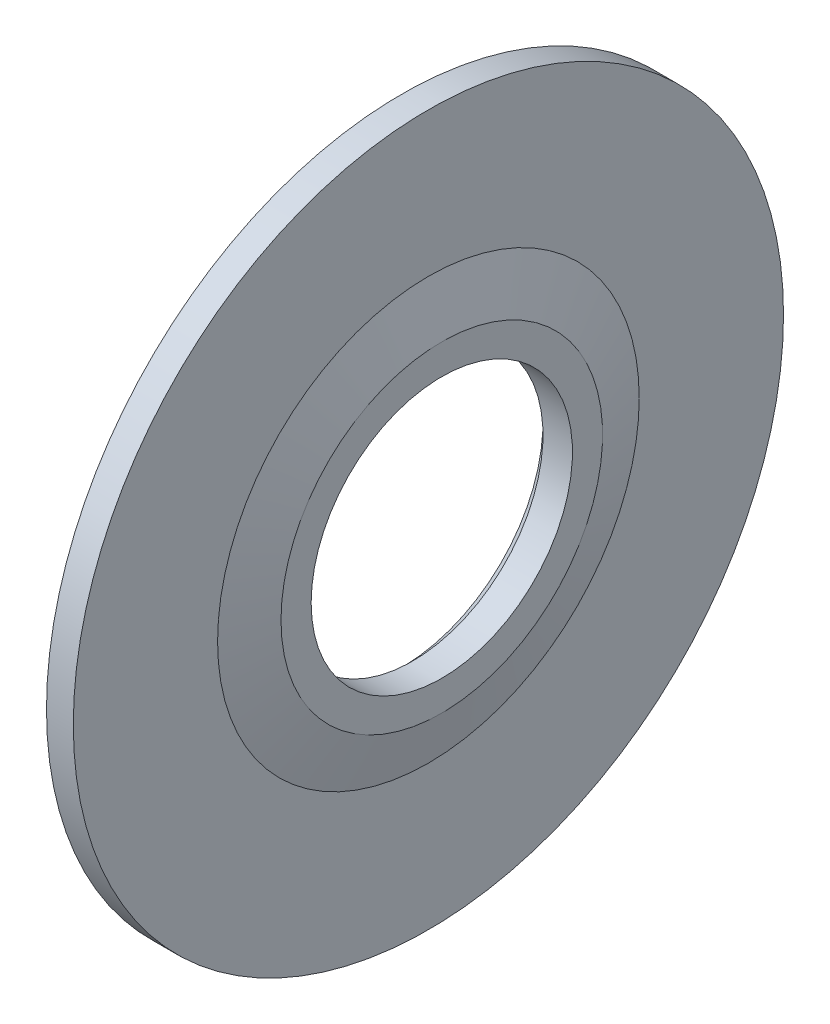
ISO-10303-21;
HEADER;
FILE_DESCRIPTION(('STEP AP214'),'2;1');
FILE_NAME('part.step','',(''),(''),'','','');
FILE_SCHEMA(('AUTOMOTIVE_DESIGN { 1 0 10303 214 1 1 1 1 }'));
ENDSEC;
DATA;
#1=APPLICATION_CONTEXT('core data for automotive mechanical design processes');
#2=APPLICATION_PROTOCOL_DEFINITION('international standard','automotive_design',2000,#1);
#3=PRODUCT_CONTEXT('',#1,'mechanical');
#4=PRODUCT('Part','Part','',(#3));
#5=PRODUCT_RELATED_PRODUCT_CATEGORY('part','',(#4));
#6=PRODUCT_DEFINITION_FORMATION('','',#4);
#7=PRODUCT_DEFINITION_CONTEXT('part definition',#1,'design');
#8=PRODUCT_DEFINITION('design','',#6,#7);
#9=PRODUCT_DEFINITION_SHAPE('','',#8);
#10=(LENGTH_UNIT() NAMED_UNIT(*) SI_UNIT(.MILLI.,.METRE.));
#11=(NAMED_UNIT(*) PLANE_ANGLE_UNIT() SI_UNIT($,.RADIAN.));
#12=(NAMED_UNIT(*) SI_UNIT($,.STERADIAN.) SOLID_ANGLE_UNIT());
#13=UNCERTAINTY_MEASURE_WITH_UNIT(LENGTH_MEASURE(1.E-05),#10,'distance_accuracy_value','');
#14=(GEOMETRIC_REPRESENTATION_CONTEXT(3) GLOBAL_UNCERTAINTY_ASSIGNED_CONTEXT((#13)) GLOBAL_UNIT_ASSIGNED_CONTEXT((#10,
#11,#12)) REPRESENTATION_CONTEXT('',''));
#15=CARTESIAN_POINT('',(0.,0.,0.));
#16=DIRECTION('',(0.,0.,1.));
#17=DIRECTION('',(1.,0.,0.));
#18=AXIS2_PLACEMENT_3D('',#15,#16,#17);
#19=CARTESIAN_POINT('',(0.,0.,0.));
#20=DIRECTION('',(-1.,0.,0.));
#21=DIRECTION('',(0.,0.,1.));
#22=AXIS2_PLACEMENT_3D('',#19,#20,#21);
#23=CYLINDRICAL_SURFACE('',#22,265.);
#24=CARTESIAN_POINT('',(0.,0.,0.));
#25=DIRECTION('',(-1.,0.,0.));
#26=DIRECTION('',(0.,0.,1.));
#27=AXIS2_PLACEMENT_3D('',#24,#25,#26);
#28=CIRCLE('',#27,265.);
#29=CARTESIAN_POINT('',(0.,0.,265.));
#30=VERTEX_POINT('',#29);
#31=EDGE_CURVE('E10',#30,#30,#28,.T.);
#32=ORIENTED_EDGE('',*,*,#31,.F.);
#33=EDGE_LOOP('',(#32));
#34=FACE_BOUND('',#33,.T.);
#35=CARTESIAN_POINT('',(20.,0.,0.));
#36=DIRECTION('',(-1.,0.,0.));
#37=DIRECTION('',(0.,0.,1.));
#38=AXIS2_PLACEMENT_3D('',#35,#36,#37);
#39=CIRCLE('',#38,265.);
#40=CARTESIAN_POINT('',(20.,0.,265.));
#41=VERTEX_POINT('',#40);
#42=EDGE_CURVE('E54',#41,#41,#39,.T.);
#43=ORIENTED_EDGE('',*,*,#42,.T.);
#44=EDGE_LOOP('',(#43));
#45=FACE_BOUND('',#44,.T.);
#46=ADVANCED_FACE('F29',(#34,#45),#23,.T.);
#47=CARTESIAN_POINT('',(0.,105.5,0.));
#48=DIRECTION('',(1.,0.,0.));
#49=DIRECTION('',(0.,0.,-1.));
#50=AXIS2_PLACEMENT_3D('',#47,#48,#49);
#51=PLANE('',#50);
#52=CARTESIAN_POINT('',(0.,0.,0.));
#53=DIRECTION('',(-1.,0.,0.));
#54=DIRECTION('',(0.,0.,1.));
#55=AXIS2_PLACEMENT_3D('',#52,#53,#54);
#56=CIRCLE('',#55,105.5);
#57=CARTESIAN_POINT('',(0.,0.,105.5));
#58=VERTEX_POINT('',#57);
#59=EDGE_CURVE('E35',#58,#58,#56,.T.);
#60=ORIENTED_EDGE('',*,*,#59,.F.);
#61=EDGE_LOOP('',(#60));
#62=FACE_BOUND('',#61,.T.);
#63=ORIENTED_EDGE('',*,*,#31,.T.);
#64=EDGE_LOOP('',(#63));
#65=FACE_BOUND('',#64,.T.);
#66=ADVANCED_FACE('F85',(#62,#65),#51,.F.);
#67=CARTESIAN_POINT('',(0.,0.,0.));
#68=DIRECTION('',(-1.,0.,0.));
#69=DIRECTION('',(0.,0.,1.));
#70=AXIS2_PLACEMENT_3D('',#67,#68,#69);
#71=CONICAL_SURFACE('',#70,105.5,0.785398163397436);
#72=CARTESIAN_POINT('',(8.,0.,0.));
#73=DIRECTION('',(-1.,0.,0.));
#74=DIRECTION('',(0.,0.,1.));
#75=AXIS2_PLACEMENT_3D('',#72,#73,#74);
#76=CIRCLE('',#75,97.5);
#77=CARTESIAN_POINT('',(8.,0.,97.5));
#78=VERTEX_POINT('',#77);
#79=EDGE_CURVE('E39',#78,#78,#76,.T.);
#80=ORIENTED_EDGE('',*,*,#79,.F.);
#81=EDGE_LOOP('',(#80));
#82=FACE_BOUND('',#81,.T.);
#83=ORIENTED_EDGE('',*,*,#59,.T.);
#84=EDGE_LOOP('',(#83));
#85=FACE_BOUND('',#84,.T.);
#86=ADVANCED_FACE('F80',(#82,#85),#71,.F.);
#87=CARTESIAN_POINT('',(0.,0.,0.));
#88=DIRECTION('',(-1.,0.,0.));
#89=DIRECTION('',(0.,0.,1.));
#90=AXIS2_PLACEMENT_3D('',#87,#88,#89);
#91=CYLINDRICAL_SURFACE('',#90,97.5);
#92=CARTESIAN_POINT('',(30.,0.,0.));
#93=DIRECTION('',(-1.,0.,0.));
#94=DIRECTION('',(0.,0.,1.));
#95=AXIS2_PLACEMENT_3D('',#92,#93,#94);
#96=CIRCLE('',#95,97.5);
#97=CARTESIAN_POINT('',(30.,0.,97.5));
#98=VERTEX_POINT('',#97);
#99=EDGE_CURVE('E43',#98,#98,#96,.T.);
#100=ORIENTED_EDGE('',*,*,#99,.F.);
#101=EDGE_LOOP('',(#100));
#102=FACE_BOUND('',#101,.T.);
#103=ORIENTED_EDGE('',*,*,#79,.T.);
#104=EDGE_LOOP('',(#103));
#105=FACE_BOUND('',#104,.T.);
#106=ADVANCED_FACE('F74',(#102,#105),#91,.F.);
#107=CARTESIAN_POINT('',(30.,120.,0.));
#108=DIRECTION('',(-1.,0.,0.));
#109=DIRECTION('',(0.,0.,1.));
#110=AXIS2_PLACEMENT_3D('',#107,#108,#109);
#111=PLANE('',#110);
#112=CARTESIAN_POINT('',(30.,0.,0.));
#113=DIRECTION('',(-1.,0.,0.));
#114=DIRECTION('',(0.,0.,1.));
#115=AXIS2_PLACEMENT_3D('',#112,#113,#114);
#116=CIRCLE('',#115,120.);
#117=CARTESIAN_POINT('',(30.,0.,120.));
#118=VERTEX_POINT('',#117);
#119=EDGE_CURVE('E48',#118,#118,#116,.T.);
#120=ORIENTED_EDGE('',*,*,#119,.F.);
#121=EDGE_LOOP('',(#120));
#122=FACE_BOUND('',#121,.T.);
#123=ORIENTED_EDGE('',*,*,#99,.T.);
#124=EDGE_LOOP('',(#123));
#125=FACE_BOUND('',#124,.T.);
#126=ADVANCED_FACE('F68',(#122,#125),#111,.F.);
#127=CARTESIAN_POINT('',(30.,0.,0.));
#128=DIRECTION('',(-1.,0.,0.));
#129=DIRECTION('',(0.,0.,1.));
#130=AXIS2_PLACEMENT_3D('',#127,#128,#129);
#131=CONICAL_SURFACE('',#130,120.,1.30899693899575);
#132=CARTESIAN_POINT('',(20.,0.,0.));
#133=DIRECTION('',(-1.,0.,0.));
#134=DIRECTION('',(0.,0.,1.));
#135=AXIS2_PLACEMENT_3D('',#132,#133,#134);
#136=CIRCLE('',#135,157.320508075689);
#137=CARTESIAN_POINT('',(20.,0.,157.320508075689));
#138=VERTEX_POINT('',#137);
#139=EDGE_CURVE('E51',#138,#138,#136,.T.);
#140=ORIENTED_EDGE('',*,*,#139,.F.);
#141=EDGE_LOOP('',(#140));
#142=FACE_BOUND('',#141,.T.);
#143=ORIENTED_EDGE('',*,*,#119,.T.);
#144=EDGE_LOOP('',(#143));
#145=FACE_BOUND('',#144,.T.);
#146=ADVANCED_FACE('F62',(#142,#145),#131,.T.);
#147=CARTESIAN_POINT('',(20.,265.,0.));
#148=DIRECTION('',(-1.,0.,0.));
#149=DIRECTION('',(0.,0.,1.));
#150=AXIS2_PLACEMENT_3D('',#147,#148,#149);
#151=PLANE('',#150);
#152=ORIENTED_EDGE('',*,*,#42,.F.);
#153=EDGE_LOOP('',(#152));
#154=FACE_BOUND('',#153,.T.);
#155=ORIENTED_EDGE('',*,*,#139,.T.);
#156=EDGE_LOOP('',(#155));
#157=FACE_BOUND('',#156,.T.);
#158=ADVANCED_FACE('F59',(#154,#157),#151,.F.);
#159=CLOSED_SHELL('',(#46,#66,#86,#106,#126,#146,#158));
#160=MANIFOLD_SOLID_BREP('B2',#159);
#161=ADVANCED_BREP_SHAPE_REPRESENTATION('',(#18,#160),#14);
#162=SHAPE_DEFINITION_REPRESENTATION(#9,#161);
ENDSEC;
END-ISO-10303-21;
